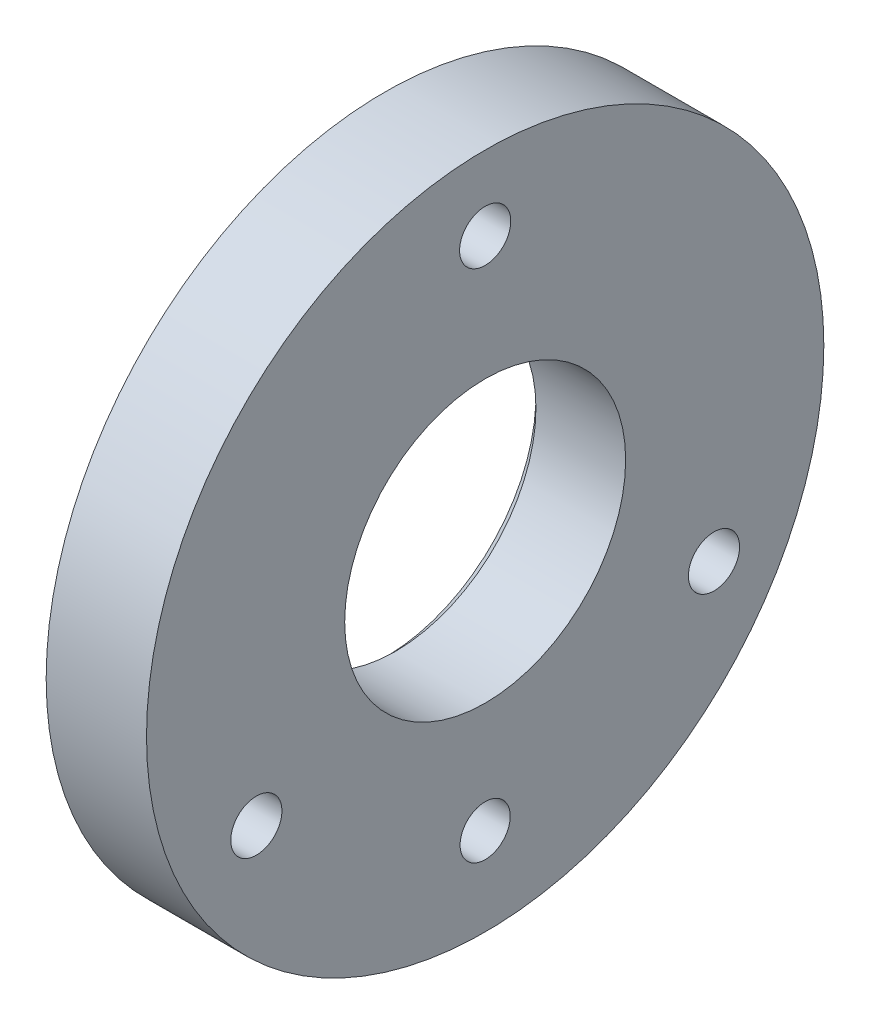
ISO-10303-21;
HEADER;
FILE_DESCRIPTION(('STEP AP214'),'2;1');
FILE_NAME('part.step','',(''),(''),'','','');
FILE_SCHEMA(('AUTOMOTIVE_DESIGN { 1 0 10303 214 1 1 1 1 }'));
ENDSEC;
DATA;
#1=APPLICATION_CONTEXT('core data for automotive mechanical design processes');
#2=APPLICATION_PROTOCOL_DEFINITION('international standard','automotive_design',2000,#1);
#3=PRODUCT_CONTEXT('',#1,'mechanical');
#4=PRODUCT('Part','Part','',(#3));
#5=PRODUCT_RELATED_PRODUCT_CATEGORY('part','',(#4));
#6=PRODUCT_DEFINITION_FORMATION('','',#4);
#7=PRODUCT_DEFINITION_CONTEXT('part definition',#1,'design');
#8=PRODUCT_DEFINITION('design','',#6,#7);
#9=PRODUCT_DEFINITION_SHAPE('','',#8);
#10=(LENGTH_UNIT() NAMED_UNIT(*) SI_UNIT(.MILLI.,.METRE.));
#11=(NAMED_UNIT(*) PLANE_ANGLE_UNIT() SI_UNIT($,.RADIAN.));
#12=(NAMED_UNIT(*) SI_UNIT($,.STERADIAN.) SOLID_ANGLE_UNIT());
#13=UNCERTAINTY_MEASURE_WITH_UNIT(LENGTH_MEASURE(1.E-05),#10,'distance_accuracy_value','');
#14=(GEOMETRIC_REPRESENTATION_CONTEXT(3) GLOBAL_UNCERTAINTY_ASSIGNED_CONTEXT((#13)) GLOBAL_UNIT_ASSIGNED_CONTEXT((#10,
#11,#12)) REPRESENTATION_CONTEXT('',''));
#15=CARTESIAN_POINT('',(0.,0.,0.));
#16=DIRECTION('',(0.,0.,1.));
#17=DIRECTION('',(1.,0.,0.));
#18=AXIS2_PLACEMENT_3D('',#15,#16,#17);
#19=CARTESIAN_POINT('',(0.,24.1822017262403,0.));
#20=DIRECTION('',(1.,0.,0.));
#21=DIRECTION('',(0.,0.,-1.));
#22=AXIS2_PLACEMENT_3D('',#19,#20,#21);
#23=PLANE('',#22);
#24=CARTESIAN_POINT('',(0.,-32.2704421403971,45.6071901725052));
#25=DIRECTION('',(-1.,0.,0.));
#26=DIRECTION('',(0.,0.,1.));
#27=AXIS2_PLACEMENT_3D('',#24,#25,#26);
#28=CIRCLE('',#27,5.09999999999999);
#29=CARTESIAN_POINT('',(0.,-32.2704421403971,50.7071901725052));
#30=VERTEX_POINT('',#29);
#31=EDGE_CURVE('E83',#30,#30,#28,.T.);
#32=ORIENTED_EDGE('',*,*,#31,.F.);
#33=EDGE_LOOP('',(#32));
#34=FACE_BOUND('',#33,.T.);
#35=CARTESIAN_POINT('',(0.,-32.2704421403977,-45.6071901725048));
#36=DIRECTION('',(-1.,0.,0.));
#37=DIRECTION('',(0.,0.,1.));
#38=AXIS2_PLACEMENT_3D('',#35,#36,#37);
#39=CIRCLE('',#38,5.09999999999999);
#40=CARTESIAN_POINT('',(0.,-32.2704421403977,-40.5071901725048));
#41=VERTEX_POINT('',#40);
#42=EDGE_CURVE('E77',#41,#41,#39,.T.);
#43=ORIENTED_EDGE('',*,*,#42,.F.);
#44=EDGE_LOOP('',(#43));
#45=FACE_BOUND('',#44,.T.);
#46=CARTESIAN_POINT('',(0.,46.723528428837,0.));
#47=DIRECTION('',(-1.,0.,0.));
#48=DIRECTION('',(0.,0.,1.));
#49=AXIS2_PLACEMENT_3D('',#46,#47,#48);
#50=CIRCLE('',#49,5.09999999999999);
#51=CARTESIAN_POINT('',(0.,46.723528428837,5.09999999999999));
#52=VERTEX_POINT('',#51);
#53=EDGE_CURVE('E71',#52,#52,#50,.T.);
#54=ORIENTED_EDGE('',*,*,#53,.F.);
#55=EDGE_LOOP('',(#54));
#56=FACE_BOUND('',#55,.T.);
#57=CARTESIAN_POINT('',(0.,-55.9391186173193,0.));
#58=DIRECTION('',(-1.,0.,0.));
#59=DIRECTION('',(0.,0.,1.));
#60=AXIS2_PLACEMENT_3D('',#57,#58,#59);
#61=CIRCLE('',#60,5.);
#62=CARTESIAN_POINT('',(0.,-55.9391186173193,5.));
#63=VERTEX_POINT('',#62);
#64=EDGE_CURVE('E65',#63,#63,#61,.T.);
#65=ORIENTED_EDGE('',*,*,#64,.F.);
#66=EDGE_LOOP('',(#65));
#67=FACE_BOUND('',#66,.T.);
#68=CARTESIAN_POINT('',(0.,-5.93911861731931,0.));
#69=DIRECTION('',(-1.,0.,0.));
#70=DIRECTION('',(0.,0.,1.));
#71=AXIS2_PLACEMENT_3D('',#68,#69,#70);
#72=CIRCLE('',#71,30.1213203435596);
#73=CARTESIAN_POINT('',(0.,-5.93911861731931,30.1213203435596));
#74=VERTEX_POINT('',#73);
#75=EDGE_CURVE('E62',#74,#74,#72,.T.);
#76=ORIENTED_EDGE('',*,*,#75,.F.);
#77=EDGE_LOOP('',(#76));
#78=FACE_BOUND('',#77,.T.);
#79=CARTESIAN_POINT('',(0.,-5.93911861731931,0.));
#80=DIRECTION('',(-1.,0.,0.));
#81=DIRECTION('',(0.,0.,1.));
#82=AXIS2_PLACEMENT_3D('',#79,#80,#81);
#83=CIRCLE('',#82,67.5);
#84=CARTESIAN_POINT('',(0.,-5.93911861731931,67.5));
#85=VERTEX_POINT('',#84);
#86=EDGE_CURVE('E10',#85,#85,#83,.T.);
#87=ORIENTED_EDGE('',*,*,#86,.T.);
#88=EDGE_LOOP('',(#87));
#89=FACE_BOUND('',#88,.T.);
#90=ADVANCED_FACE('F43',(#34,#45,#56,#67,#78,#89),#23,.F.);
#91=CARTESIAN_POINT('',(-82.0651866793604,-5.93911861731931,0.));
#92=DIRECTION('',(-1.,0.,0.));
#93=DIRECTION('',(0.,0.,1.));
#94=AXIS2_PLACEMENT_3D('',#91,#92,#93);
#95=CYLINDRICAL_SURFACE('',#94,67.5);
#96=ORIENTED_EDGE('',*,*,#86,.F.);
#97=EDGE_LOOP('',(#96));
#98=FACE_BOUND('',#97,.T.);
#99=CARTESIAN_POINT('',(20.,-5.93911861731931,0.));
#100=DIRECTION('',(-1.,0.,0.));
#101=DIRECTION('',(0.,0.,1.));
#102=AXIS2_PLACEMENT_3D('',#99,#100,#101);
#103=CIRCLE('',#102,67.5);
#104=CARTESIAN_POINT('',(20.,-5.93911861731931,67.5));
#105=VERTEX_POINT('',#104);
#106=EDGE_CURVE('E50',#105,#105,#103,.T.);
#107=ORIENTED_EDGE('',*,*,#106,.T.);
#108=EDGE_LOOP('',(#107));
#109=FACE_BOUND('',#108,.T.);
#110=ADVANCED_FACE('F91',(#98,#109),#95,.T.);
#111=CARTESIAN_POINT('',(20.,61.5608813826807,0.));
#112=DIRECTION('',(-1.,0.,0.));
#113=DIRECTION('',(0.,0.,1.));
#114=AXIS2_PLACEMENT_3D('',#111,#112,#113);
#115=PLANE('',#114);
#116=CARTESIAN_POINT('',(20.,-32.2704421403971,45.6071901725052));
#117=DIRECTION('',(-1.,0.,0.));
#118=DIRECTION('',(0.,0.,1.));
#119=AXIS2_PLACEMENT_3D('',#116,#117,#118);
#120=CIRCLE('',#119,5.09999999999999);
#121=CARTESIAN_POINT('',(20.,-32.2704421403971,50.7071901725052));
#122=VERTEX_POINT('',#121);
#123=EDGE_CURVE('E80',#122,#122,#120,.T.);
#124=ORIENTED_EDGE('',*,*,#123,.T.);
#125=EDGE_LOOP('',(#124));
#126=FACE_BOUND('',#125,.T.);
#127=CARTESIAN_POINT('',(20.,-32.2704421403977,-45.6071901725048));
#128=DIRECTION('',(-1.,0.,0.));
#129=DIRECTION('',(0.,0.,1.));
#130=AXIS2_PLACEMENT_3D('',#127,#128,#129);
#131=CIRCLE('',#130,5.09999999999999);
#132=CARTESIAN_POINT('',(20.,-32.2704421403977,-40.5071901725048));
#133=VERTEX_POINT('',#132);
#134=EDGE_CURVE('E74',#133,#133,#131,.T.);
#135=ORIENTED_EDGE('',*,*,#134,.T.);
#136=EDGE_LOOP('',(#135));
#137=FACE_BOUND('',#136,.T.);
#138=CARTESIAN_POINT('',(20.,46.723528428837,0.));
#139=DIRECTION('',(-1.,0.,0.));
#140=DIRECTION('',(0.,0.,1.));
#141=AXIS2_PLACEMENT_3D('',#138,#139,#140);
#142=CIRCLE('',#141,5.09999999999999);
#143=CARTESIAN_POINT('',(20.,46.723528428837,5.09999999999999));
#144=VERTEX_POINT('',#143);
#145=EDGE_CURVE('E68',#144,#144,#142,.T.);
#146=ORIENTED_EDGE('',*,*,#145,.T.);
#147=EDGE_LOOP('',(#146));
#148=FACE_BOUND('',#147,.T.);
#149=CARTESIAN_POINT('',(20.,-55.9391186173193,0.));
#150=DIRECTION('',(-1.,0.,0.));
#151=DIRECTION('',(0.,0.,1.));
#152=AXIS2_PLACEMENT_3D('',#149,#150,#151);
#153=CIRCLE('',#152,5.);
#154=CARTESIAN_POINT('',(20.,-55.9391186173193,5.));
#155=VERTEX_POINT('',#154);
#156=EDGE_CURVE('E46',#155,#155,#153,.T.);
#157=ORIENTED_EDGE('',*,*,#156,.T.);
#158=EDGE_LOOP('',(#157));
#159=FACE_BOUND('',#158,.T.);
#160=ORIENTED_EDGE('',*,*,#106,.F.);
#161=EDGE_LOOP('',(#160));
#162=FACE_BOUND('',#161,.T.);
#163=CARTESIAN_POINT('',(20.,-5.93911861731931,0.));
#164=DIRECTION('',(-1.,0.,0.));
#165=DIRECTION('',(0.,0.,1.));
#166=AXIS2_PLACEMENT_3D('',#163,#164,#165);
#167=CIRCLE('',#166,28.);
#168=CARTESIAN_POINT('',(20.,-5.93911861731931,28.));
#169=VERTEX_POINT('',#168);
#170=EDGE_CURVE('E54',#169,#169,#167,.T.);
#171=ORIENTED_EDGE('',*,*,#170,.T.);
#172=EDGE_LOOP('',(#171));
#173=FACE_BOUND('',#172,.T.);
#174=ADVANCED_FACE('F113',(#126,#137,#148,#159,#162,#173),#115,.F.);
#175=CARTESIAN_POINT('',(-82.0651866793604,-5.93911861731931,0.));
#176=DIRECTION('',(-1.,0.,0.));
#177=DIRECTION('',(0.,0.,1.));
#178=AXIS2_PLACEMENT_3D('',#175,#176,#177);
#179=CYLINDRICAL_SURFACE('',#178,28.);
#180=ORIENTED_EDGE('',*,*,#170,.F.);
#181=EDGE_LOOP('',(#180));
#182=FACE_BOUND('',#181,.T.);
#183=CARTESIAN_POINT('',(2.12132034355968,-5.93911861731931,0.));
#184=DIRECTION('',(-1.,0.,0.));
#185=DIRECTION('',(0.,0.,1.));
#186=AXIS2_PLACEMENT_3D('',#183,#184,#185);
#187=CIRCLE('',#186,28.);
#188=CARTESIAN_POINT('',(2.12132034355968,-5.93911861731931,28.));
#189=VERTEX_POINT('',#188);
#190=EDGE_CURVE('E59',#189,#189,#187,.T.);
#191=ORIENTED_EDGE('',*,*,#190,.T.);
#192=EDGE_LOOP('',(#191));
#193=FACE_BOUND('',#192,.T.);
#194=ADVANCED_FACE('F103',(#182,#193),#179,.F.);
#195=CARTESIAN_POINT('',(0.,-5.93911861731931,0.));
#196=DIRECTION('',(-1.,0.,0.));
#197=DIRECTION('',(0.,0.,1.));
#198=AXIS2_PLACEMENT_3D('',#195,#196,#197);
#199=CONICAL_SURFACE('',#198,30.1213203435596,0.785398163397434);
#200=ORIENTED_EDGE('',*,*,#190,.F.);
#201=EDGE_LOOP('',(#200));
#202=FACE_BOUND('',#201,.T.);
#203=ORIENTED_EDGE('',*,*,#75,.T.);
#204=EDGE_LOOP('',(#203));
#205=FACE_BOUND('',#204,.T.);
#206=ADVANCED_FACE('F100',(#202,#205),#199,.F.);
#207=CARTESIAN_POINT('',(39.,-55.9391186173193,0.));
#208=DIRECTION('',(-1.,0.,0.));
#209=DIRECTION('',(0.,0.,1.));
#210=AXIS2_PLACEMENT_3D('',#207,#208,#209);
#211=CYLINDRICAL_SURFACE('',#210,5.);
#212=ORIENTED_EDGE('',*,*,#64,.T.);
#213=EDGE_LOOP('',(#212));
#214=FACE_BOUND('',#213,.T.);
#215=ORIENTED_EDGE('',*,*,#156,.F.);
#216=EDGE_LOOP('',(#215));
#217=FACE_BOUND('',#216,.T.);
#218=ADVANCED_FACE('F102',(#214,#217),#211,.F.);
#219=CARTESIAN_POINT('',(0.,46.723528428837,0.));
#220=DIRECTION('',(-1.,0.,0.));
#221=DIRECTION('',(0.,0.,1.));
#222=AXIS2_PLACEMENT_3D('',#219,#220,#221);
#223=CYLINDRICAL_SURFACE('',#222,5.09999999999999);
#224=ORIENTED_EDGE('',*,*,#145,.F.);
#225=EDGE_LOOP('',(#224));
#226=FACE_BOUND('',#225,.T.);
#227=ORIENTED_EDGE('',*,*,#53,.T.);
#228=EDGE_LOOP('',(#227));
#229=FACE_BOUND('',#228,.T.);
#230=ADVANCED_FACE('F110',(#226,#229),#223,.F.);
#231=CARTESIAN_POINT('',(0.,-32.2704421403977,-45.6071901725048));
#232=DIRECTION('',(-1.,0.,0.));
#233=DIRECTION('',(0.,0.,1.));
#234=AXIS2_PLACEMENT_3D('',#231,#232,#233);
#235=CYLINDRICAL_SURFACE('',#234,5.09999999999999);
#236=ORIENTED_EDGE('',*,*,#134,.F.);
#237=EDGE_LOOP('',(#236));
#238=FACE_BOUND('',#237,.T.);
#239=ORIENTED_EDGE('',*,*,#42,.T.);
#240=EDGE_LOOP('',(#239));
#241=FACE_BOUND('',#240,.T.);
#242=ADVANCED_FACE('F164',(#238,#241),#235,.F.);
#243=CARTESIAN_POINT('',(0.,-32.2704421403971,45.6071901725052));
#244=DIRECTION('',(-1.,0.,0.));
#245=DIRECTION('',(0.,0.,1.));
#246=AXIS2_PLACEMENT_3D('',#243,#244,#245);
#247=CYLINDRICAL_SURFACE('',#246,5.09999999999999);
#248=ORIENTED_EDGE('',*,*,#123,.F.);
#249=EDGE_LOOP('',(#248));
#250=FACE_BOUND('',#249,.T.);
#251=ORIENTED_EDGE('',*,*,#31,.T.);
#252=EDGE_LOOP('',(#251));
#253=FACE_BOUND('',#252,.T.);
#254=ADVANCED_FACE('F87',(#250,#253),#247,.F.);
#255=CLOSED_SHELL('',(#90,#110,#174,#194,#206,#218,#230,#242,#254));
#256=MANIFOLD_SOLID_BREP('B2',#255);
#257=ADVANCED_BREP_SHAPE_REPRESENTATION('',(#18,#256),#14);
#258=SHAPE_DEFINITION_REPRESENTATION(#9,#257);
ENDSEC;
END-ISO-10303-21;
